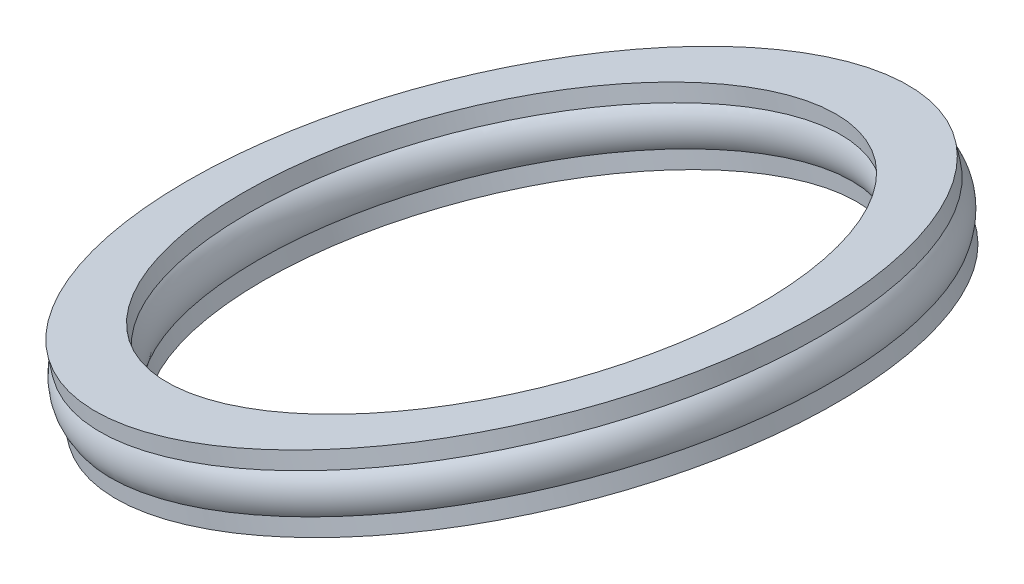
from build123d import *

# Parameters (mm, degrees)
SK_BOLAS_R = 2.0000000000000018


with BuildPart() as part:
    # Sk_Jaula → Jaula (revolve)
    with BuildSketch(Plane.XY, mode=Mode.PRIVATE) as jaula_sk:
        Polygon((380.26368558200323, 538.3272855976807), (383.50631412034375, 539.3497141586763), (384.70917125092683, 535.5348570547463), (381.4665427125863, 534.5124284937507), align=None)
    revolve(jaula_sk.sketch.rotate(Axis((363.69142860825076, 538.3445713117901, 0), (0.3007142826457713, -0.9537142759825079, 0)), 180), axis=Axis((363.69142860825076, 538.3445713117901, 0), (0.3007142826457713, -0.9537142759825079, 0)))

    # Sk_Bolas → Bolas (revolve)
    with BuildSketch(Plane.XY, mode=Mode.PRIVATE) as bolas_sk:
        with Locations((382.486428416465, 536.9310713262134)):
            Circle(SK_BOLAS_R)
    revolve(bolas_sk.sketch.rotate(Axis((362.7892857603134, 541.2057141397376, 0), (0.3007142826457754, -0.9537142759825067, 0)), 180), axis=Axis((362.7892857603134, 541.2057141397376, 0), (0.3007142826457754, -0.9537142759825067, 0)))


solid = part.part
